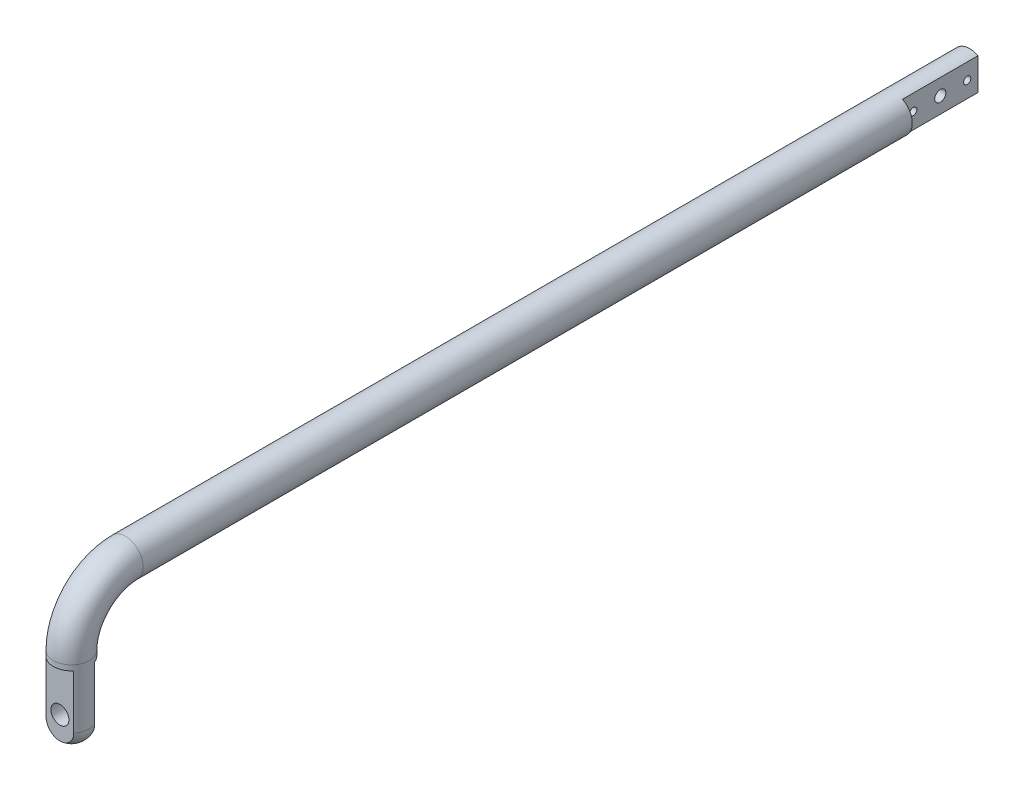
from build123d import *

# Parameters (mm, degrees)
ESQUISSE1_R                  = 5
CONG_1_R                     = 5
ESQUISSE11_W                 = 3.467887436
ESQUISSE11_H                 = 21.457854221
ENL_V_MAT_EXTRU_1_DEPTH      = 5
ENL_V_MAT_EXTRU_2_REACH      = 259.694
ENL_V_MAT_EXTRU_2_END_RADIUS = 5
ESQUISSE12_R                 = 1.55
ESQUISSE13_R                 = 1
ENL_V_MAT_EXTRU_3_DEPTH      = 2
ESQUISSE14_W                 = 3.2
ESQUISSE14_H                 = 20
ESQUISSE14_W_2               = 1.813543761
ENL_V_MAT_EXTRU_4_DEPTH      = 5
ENL_V_MAT_EXTRU_5_REACH      = 252.911
ESQUISSE15_R                 = 2.5


with BuildPart() as part:
    # Balayage1: sweep along a path in Esquisse10
    with BuildLine(Plane(origin=(0, 0, 0), x_dir=(0, 0, -1), z_dir=(1, 0, 0))) as balayage1_path:
        Line((0, 0), (-235, 0))
        ThreePointArc((-235, 0), (-245.606601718, -4.393398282), (-250, -15))
        Line((-250, -15), (-250, -36.44))
    # Esquisse1 → Balayage1 (sweep)
    with BuildSketch(Plane.XY):
        Circle(ESQUISSE1_R)
    sweep(path=balayage1_path.line)

    # Cong_1
    cong_1_edges = [part.edges().sort_by_distance(p)[0] for p in [
        (-5, -36.44, 250),
    ]]
    fillet(cong_1_edges, radius=CONG_1_R)

    # Esquisse11 → Enl_v. mat.-Extru.1 (cut, symmetric)
    with BuildSketch(Plane(origin=(0, 0, 0), x_dir=(1, 0, 0), z_dir=(0, 1, 0))):
        with Locations((4.033943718, -10.271072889)):
            Rectangle(ESQUISSE11_W, ESQUISSE11_H)
    extrude(amount=ENL_V_MAT_EXTRU_1_DEPTH, both=True, mode=Mode.SUBTRACT)

    # Enl_v. mat.-Extru.2: up to this cylinder (the profile starts inside it)
    enl_v_mat_extru_2_end = Plane(origin=(0, 0, 10.5), z_dir=(0, 0, -1)) * Cylinder(ENL_V_MAT_EXTRU_2_END_RADIUS, 530.388, mode=Mode.PRIVATE)
    # Esquisse12 → Enl_v. mat.-Extru.2 (cut, up to the surface)
    with BuildSketch(Plane(origin=(2.3, 0, 0), x_dir=(0, 0, -1), z_dir=(1, 0, 0)), mode=Mode.PRIVATE) as enl_v_mat_extru_2_sk1:
        with Locations((-10.5, 0)):
            Circle(ESQUISSE12_R)
    enl_v_mat_extru_2_tool1 = extrude(enl_v_mat_extru_2_sk1.sketch, amount=-ENL_V_MAT_EXTRU_2_REACH, mode=Mode.PRIVATE) & enl_v_mat_extru_2_end
    add(enl_v_mat_extru_2_tool1.solids().sort_by_distance((2.3, 0, 10.5))[0], mode=Mode.SUBTRACT)

    # Esquisse13 → Enl_v. mat.-Extru.3 (cut)
    with BuildSketch(Plane(origin=(2.3, 0, 0), x_dir=(0, 0, -1), z_dir=(1, 0, 0))):
        with Locations((-3, 0)):
            Circle(ESQUISSE13_R)
        with Locations(Location((-18, 0, 0), (0, 0, 180))):
            Circle(ESQUISSE13_R)
    extrude(amount=-ENL_V_MAT_EXTRU_3_DEPTH, mode=Mode.SUBTRACT)

    # Esquisse14 → Enl_v. mat.-Extru.4 (cut, symmetric)
    with BuildSketch(Plane(origin=(0, 0, 0), x_dir=(0, 0, -1), z_dir=(1, 0, 0))):
        with Locations((-246.6, -26.44)):
            Rectangle(ESQUISSE14_W, ESQUISSE14_H)
        with Locations((-254.106771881, -26.44)):
            Rectangle(ESQUISSE14_W_2, ESQUISSE14_H)
    extrude(amount=ENL_V_MAT_EXTRU_4_DEPTH, both=True, mode=Mode.SUBTRACT)

    # Esquisse15 → Enl_v. mat.-Extru.5 (cut, up to next)
    with BuildSketch(Plane(origin=(0, 0, 248.2), x_dir=(-1, 0, 0), z_dir=(0, 0, -1)), mode=Mode.PRIVATE) as enl_v_mat_extru_5_sk1:
        with Locations((0, -28.94)):
            Circle(ESQUISSE15_R)
    enl_v_mat_extru_5_tool1 = extrude(enl_v_mat_extru_5_sk1.sketch, amount=-ENL_V_MAT_EXTRU_5_REACH, mode=Mode.PRIVATE) & part.part
    add(enl_v_mat_extru_5_tool1.solids().sort_by_distance((0, -28.94, 248.2))[0], mode=Mode.SUBTRACT)


solid = part.part
